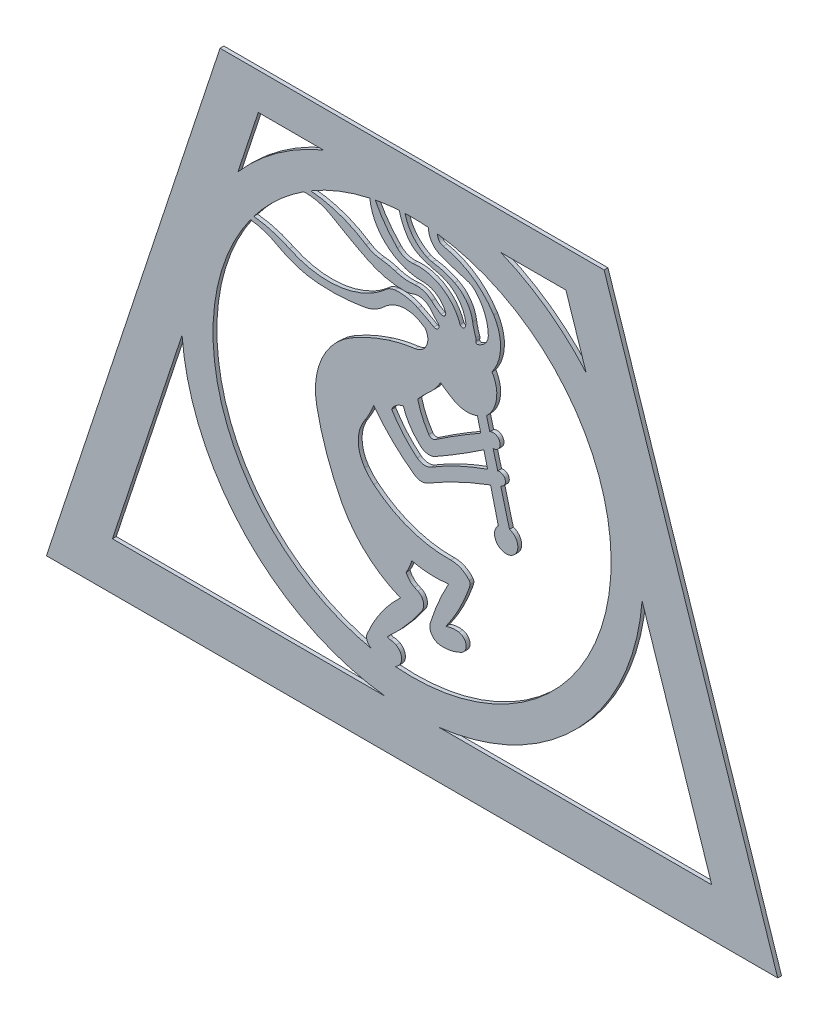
from build123d import *

# Parameters (mm, degrees)
BOSS_EXTRUDE1_DEPTH = 6.35


with BuildPart() as part:
    # Model → Boss-Extrude1 (new body)
    with BuildSketch(Plane.XY):
        Polygon((-355.683969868, 310.919702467), (-642.116316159, -557.460324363), (564.383683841, -557.460324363), (277.95133755, 310.919702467), align=None)
        with BuildLine():
            Line((-82.977968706, -478.720324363), (-533.231339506, -478.720324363))
            Line((-533.231339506, -478.720324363), (-418.350189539, -130.433905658))
            ThreePointArc((-418.350189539, -130.433905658), (-313.063598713, -364.66290745), (-82.977968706, -478.720324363))
        make_face(mode=Mode.SUBTRACT)
        with BuildLine():
            ThreePointArc((-113.19013671, -404.849817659), (-112.400886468, -415.691031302), (-103.949326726, -422.526670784))
            ThreePointArc((-103.949326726, -422.526670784), (-344.586283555, -220.577883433), (-305.474493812, 91.126665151))
            ThreePointArc((-305.474493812, 91.126665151), (-282.394363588, 86.159913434), (-260.831638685, 76.546905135))
            ThreePointArc((-260.831638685, 76.546905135), (-228.528995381, 62.512276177), (-193.900261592, 56.087140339))
            ThreePointArc((-193.900261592, 56.087140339), (-155.687471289, 55.731105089), (-117.714824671, 60.023215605))
            ThreePointArc((-117.714824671, 60.023215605), (-100.26348824, 65.852929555), (-85.291060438, 76.546905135))
            ThreePointArc((-85.291060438, 76.546905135), (-75.955065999, 83.805188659), (-65.27740604, 88.887614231))
            ThreePointArc((-65.27740604, 88.887614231), (-42.904202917, 91.123987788), (-21.965915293, 82.929495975))
            ThreePointArc((-21.965915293, 82.929495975), (-20.268598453, 81.850539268), (-18.484641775, 80.921814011))
            ThreePointArc((-18.484641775, 80.921814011), (-17.313302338, 80.14995648), (-16.413266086, 79.073975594))
            ThreePointArc((-16.413266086, 79.073975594), (-15.207691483, 56.087140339), (-33.856354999, 42.593610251))
            ThreePointArc((-33.856354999, 42.593610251), (-55.885482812, 38.747961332), (-77.481253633, 32.943293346))
            ThreePointArc((-77.481253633, 32.943293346), (-109.431154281, 20.770376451), (-139.802673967, 5.068566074))
            ThreePointArc((-139.802673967, 5.068566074), (-187.921004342, -48.811676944), (-196.047600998, -120.591985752))
            ThreePointArc((-196.047600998, -120.591985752), (-179.590921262, -180.773932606), (-154.720726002, -237.994229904))
            ThreePointArc((-154.720726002, -237.994229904), (-114.179016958, -290.43293551), (-58.002011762, -325.61236281))
            ThreePointArc((-58.002011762, -325.61236281), (-89.82843825, -362.283289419), (-113.19013671, -404.849817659))
        make_face(mode=Mode.SUBTRACT)
        with BuildLine():
            Line((340.617557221, -130.433905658), (455.498707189, -478.720324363))
            Line((455.498707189, -478.720324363), (5.245336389, -478.720324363))
            ThreePointArc((5.245336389, -478.720324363), (235.330966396, -364.66290745), (340.617557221, -130.433905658))
        make_face(mode=Mode.SUBTRACT)
        with BuildLine():
            Line((-326.147226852, 149.098808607), (-292.632403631, 250.706058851))
            Line((-292.632403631, 250.706058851), (-185.349195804, 250.706058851))
            ThreePointArc((-185.349195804, 250.706058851), (-261.619014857, 208.037656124), (-326.147226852, 149.098808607))
        make_face(mode=Mode.SUBTRACT)
        with BuildLine():
            ThreePointArc((-82.228886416, 102.978990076), (-93.975797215, 93.535803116), (-106.726278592, 85.499080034))
            ThreePointArc((-106.726278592, 85.499080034), (-173.491689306, 67.301481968), (-241.14593954, 81.85053927))
            ThreePointArc((-241.14593954, 81.85053927), (-269.827249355, 92.770969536), (-299.965843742, 98.56220933))
            ThreePointArc((-299.965843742, 98.56220933), (-262.040850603, 140.291990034), (-217.536225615, 174.918830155))
            ThreePointArc((-217.536225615, 174.918830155), (-193.04261506, 172.244649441), (-170.341728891, 162.665611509))
            ThreePointArc((-170.341728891, 162.665611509), (-141.704772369, 146.078511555), (-112.440538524, 130.624975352))
            ThreePointArc((-112.440538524, 130.624975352), (-82.792599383, 119.847214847), (-51.449295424, 116.275420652))
            ThreePointArc((-51.449295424, 116.275420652), (-44.056739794, 117.000722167), (-36.928593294, 119.090092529))
            ThreePointArc((-36.928593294, 119.090092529), (-21.266411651, 120.014438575), (-8.149144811, 111.406554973))
            ThreePointArc((-8.149144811, 111.406554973), (-2.309804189, 104.464922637), (3.924128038, 97.875366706))
            ThreePointArc((3.924128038, 97.875366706), (4.433592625, 90.385615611), (-2.922487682, 88.887614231))
            ThreePointArc((-2.922487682, 88.887614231), (-16.005398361, 96.111442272), (-29.278793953, 102.978990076))
            ThreePointArc((-29.278793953, 102.978990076), (-47.727090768, 109.101732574), (-67.154006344, 109.751795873))
            ThreePointArc((-67.154006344, 109.751795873), (-75.224405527, 107.551650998), (-82.228886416, 102.978990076))
        make_face(mode=Mode.SUBTRACT)
        with BuildLine():
            ThreePointArc((-90.290443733, 141.958938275), (-103.053420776, 144.713569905), (-114.751190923, 150.513893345))
            ThreePointArc((-114.751190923, 150.513893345), (-158.424024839, 172.050610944), (-206.088555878, 182.012493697))
            ThreePointArc((-206.088555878, 182.012493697), (-158.868773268, 205.064855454), (-108.576794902, 220.291022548))
            ThreePointArc((-108.576794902, 220.291022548), (-102.583430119, 197.164363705), (-90.168395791, 176.752854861))
            ThreePointArc((-90.168395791, 176.752854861), (-59.321974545, 152.981413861), (-21.266411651, 144.713569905))
            ThreePointArc((-21.266411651, 144.713569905), (1.272640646, 138.049911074), (16.299222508, 119.977416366))
            ThreePointArc((16.299222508, 119.977416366), (14.97267176, 113.943834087), (8.842400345, 113.179880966))
            ThreePointArc((8.842400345, 113.179880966), (0.664579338, 118.279660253), (-6.76620035, 124.417087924))
            ThreePointArc((-6.76620035, 124.417087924), (-19.411326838, 132.006675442), (-34.072987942, 133.599395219))
            ThreePointArc((-34.072987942, 133.599395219), (-50.804621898, 133.589482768), (-67.154006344, 137.145506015))
            ThreePointArc((-67.154006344, 137.145506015), (-78.581964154, 140.226405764), (-90.290443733, 141.958938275))
        make_face(mode=Mode.SUBTRACT)
        with BuildLine():
            Line((85.715554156, -69.987132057), (85.710410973, -69.989006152))
            ThreePointArc((85.710410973, -69.989006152), (38.106369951, -89.240462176), (-7.227212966, -113.357459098))
            ThreePointArc((-7.227212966, -113.357459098), (-19.17915239, -116.207351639), (-30.588730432, -111.647497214))
            ThreePointArc((-30.588730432, -111.647497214), (-53.61814559, -89.275287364), (-72.604345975, -63.383320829))
            ThreePointArc((-72.604345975, -63.383320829), (-64.668004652, -53.878526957), (-53.218975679, -49.1619227))
            ThreePointArc((-53.218975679, -49.1619227), (-41.59859394, -73.035723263), (-23.898401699, -92.827004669))
            ThreePointArc((-23.898401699, -92.827004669), (-12.661855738, -97.553011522), (-0.742605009, -94.998296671))
            ThreePointArc((-0.742605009, -94.998296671), (39.918665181, -70.87297718), (79.597073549, -45.163176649))
            Line((79.597073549, -45.163176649), (85.715554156, -69.987132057))
        make_face(mode=Mode.SUBTRACT)
        with BuildLine():
            ThreePointArc((103.434089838, -141.874936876), (120.716798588, -174.886235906), (121.809660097, -137.640517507))
            Line((121.809660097, -137.640517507), (107.341819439, -82.735476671))
            Line((107.341819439, -82.735476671), (107.588580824, -82.628494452))
            ThreePointArc((107.588580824, -82.628494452), (114.809086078, -70.536342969), (102.381253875, -63.910272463))
            Line((102.381253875, -63.910272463), (94.994111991, -35.876280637))
            ThreePointArc((94.994111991, -35.876280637), (95.2215504, -35.754945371), (95.449169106, -35.633948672))
            ThreePointArc((95.449169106, -35.633948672), (105.948694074, -21.136240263), (89.346483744, -14.443693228))
            Line((89.346483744, -14.443693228), (84.00883033, 5.812548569))
            ThreePointArc((84.00883033, 5.812548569), (100.452490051, 37.790603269), (93.013357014, 72.970842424))
            ThreePointArc((93.013357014, 72.970842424), (107.087762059, 113.857194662), (95.733162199, 155.580758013))
            ThreePointArc((95.733162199, 155.580758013), (60.042720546, 192.524508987), (12.63048004, 212.291345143))
            ThreePointArc((12.63048004, 212.291345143), (5.469188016, 216.842082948), (3.329845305, 225.052839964))
            ThreePointArc((3.329845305, 225.052839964), (287.644020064, -135.882575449), (-67.154006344, -427.819699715))
            ThreePointArc((-67.154006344, -427.819699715), (-56.197810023, -412.84128312), (-65.157325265, -396.589566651))
            ThreePointArc((-65.157325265, -396.589566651), (-69.973189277, -394.648067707), (-75.106515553, -393.86645036))
            ThreePointArc((-75.106515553, -393.86645036), (-77.520180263, -393.14198019), (-79.267396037, -391.325975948))
            ThreePointArc((-79.267396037, -391.325975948), (-49.016941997, -360.712060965), (-22.785731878, -326.591313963))
            ThreePointArc((-22.785731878, -326.591313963), (-20.354122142, -312.530826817), (-29.249351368, -301.373545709))
            ThreePointArc((-29.249351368, -301.373545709), (-32.247950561, -300.206106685), (-35.158192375, -298.83315236))
            ThreePointArc((-35.158192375, -298.83315236), (-43.19100603, -292.708827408), (-48.622753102, -284.192397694))
            ThreePointArc((-48.622753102, -284.192397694), (-43.284424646, -274.019161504), (-39.316975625, -263.237147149))
            ThreePointArc((-39.316975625, -263.237147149), (-9.116063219, -267.414880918), (21.340909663, -266.028745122))
            ThreePointArc((21.340909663, -266.028745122), (4.573942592, -300.449451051), (-8.681930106, -336.36877761))
            ThreePointArc((-8.681930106, -336.36877761), (-6.217481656, -352.54193554), (8.061937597, -360.525839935))
            ThreePointArc((8.061937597, -360.525839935), (25.968437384, -359.098217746), (42.851616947, -352.963147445))
            ThreePointArc((42.851616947, -352.963147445), (50.262615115, -338.1287647), (38.534984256, -326.405092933))
            ThreePointArc((38.534984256, -326.405092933), (27.473736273, -326.17401138), (16.77884206, -329.006650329))
            ThreePointArc((16.77884206, -329.006650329), (38.649923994, -293.402228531), (55.305632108, -255.079826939))
            ThreePointArc((55.305632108, -255.079826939), (56.154021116, -252.277858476), (56.743975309, -249.410325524))
            ThreePointArc((56.743975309, -249.410325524), (56.595474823, -246.575850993), (55.305632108, -244.047491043))
            ThreePointArc((55.305632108, -244.047491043), (41.766778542, -233.517662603), (24.972014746, -230.03718104))
            ThreePointArc((24.972014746, -230.03718104), (-42.601054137, -219.378978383), (-102.058321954, -185.547776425))
            ThreePointArc((-102.058321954, -185.547776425), (-110.154747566, -177.787652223), (-117.151634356, -169.023223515))
            ThreePointArc((-117.151634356, -169.023223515), (-127.666759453, -135.990255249), (-117.753326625, -102.771755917))
            ThreePointArc((-117.753326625, -102.771755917), (-109.113154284, -88.107326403), (-102.187250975, -72.559659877))
            ThreePointArc((-102.187250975, -72.559659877), (-71.182309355, -107.963885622), (-35.049314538, -138.116369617))
            ThreePointArc((-35.049314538, -138.116369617), (-24.142086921, -141.849197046), (-12.959423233, -139.047474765))
            ThreePointArc((-12.959423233, -139.047474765), (37.727296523, -112.159280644), (90.642007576, -89.974783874))
            Line((90.642007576, -89.974783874), (103.434089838, -141.874936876))
        make_face(mode=Mode.SUBTRACT)
        with BuildLine():
            ThreePointArc((29.229864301, 1.083696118), (48.742015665, -4.854616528), (68.905522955, -1.785319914))
            Line((68.905522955, -1.785319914), (74.389880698, -24.036506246))
            ThreePointArc((74.389880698, -24.036506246), (74.387364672, -24.037936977), (74.384848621, -24.039367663))
            ThreePointArc((74.384848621, -24.039367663), (36.390754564, -46.63963106), (-0.688719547, -70.711101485))
            ThreePointArc((-0.688719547, -70.711101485), (-6.404198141, -71.884716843), (-11.274409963, -68.671446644))
            ThreePointArc((-11.274409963, -68.671446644), (-22.281800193, -48.764779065), (-29.564764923, -27.214918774))
            ThreePointArc((-29.564764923, -27.214918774), (-17.997233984, -14.968476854), (-5.84670301, -3.30024182))
            ThreePointArc((-5.84670301, -3.30024182), (1.94994827, 5.296769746), (8.014329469, 15.192206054))
            ThreePointArc((8.014329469, 15.192206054), (18.381545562, 7.77622437), (29.229864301, 1.083696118))
        make_face(mode=Mode.SUBTRACT)
        with BuildLine():
            ThreePointArc((-99.749732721, 222.082028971), (-79.986331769, 225.190459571), (-60.07032787, 227.089708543))
            ThreePointArc((-60.07032787, 227.089708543), (-54.641576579, 211.169011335), (-46.589338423, 196.400754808))
            ThreePointArc((-46.589338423, 196.400754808), (-36.743702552, 185.548080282), (-24.096103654, 178.148395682))
            ThreePointArc((-24.096103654, 178.148395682), (-10.264984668, 173.339932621), (3.924128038, 169.721887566))
            ThreePointArc((3.924128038, 169.721887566), (33.835507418, 153.295039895), (49.550349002, 123.003527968))
            ThreePointArc((49.550349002, 123.003527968), (49.674420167, 118.40798254), (48.376860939, 113.997679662))
            ThreePointArc((48.376860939, 113.997679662), (44.169928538, 111.488213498), (40.248586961, 114.423989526))
            ThreePointArc((40.248586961, 114.423989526), (10.090111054, 152.087432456), (-36.986111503, 162.665611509))
            ThreePointArc((-36.986111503, 162.665611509), (-51.333391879, 164.263959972), (-63.523188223, 171.997525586))
            ThreePointArc((-63.523188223, 171.997525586), (-83.54390124, 195.660109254), (-99.749732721, 222.082028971))
        make_face(mode=Mode.SUBTRACT)
        with BuildLine():
            ThreePointArc((-11.791081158, 226.656955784), (-6.449875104, 208.655393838), (8.255800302, 196.979443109))
            ThreePointArc((8.255800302, 196.979443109), (29.986001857, 189.263330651), (52.064130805, 182.607786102))
            ThreePointArc((52.064130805, 182.607786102), (59.222486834, 179.545273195), (65.29807644, 174.676160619))
            ThreePointArc((65.29807644, 174.676160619), (81.048046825, 150.305572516), (86.875822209, 121.879806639))
            ThreePointArc((86.875822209, 121.879806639), (85.437898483, 114.030652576), (81.088482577, 107.340404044))
            ThreePointArc((81.088482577, 107.340404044), (75.811902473, 103.061719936), (69.696661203, 100.103129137))
            ThreePointArc((69.696661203, 100.103129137), (67.012397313, 100.708464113), (66.371944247, 103.384566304))
            ThreePointArc((66.371944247, 103.384566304), (66.721917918, 105.620037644), (66.32039672, 107.846827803))
            ThreePointArc((66.32039672, 107.846827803), (63.222606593, 117.95938655), (61.108139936, 128.322261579))
            ThreePointArc((61.108139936, 128.322261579), (51.183996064, 152.418335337), (31.342034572, 169.312297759))
            ThreePointArc((31.342034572, 169.312297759), (13.377405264, 176.522503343), (-5.558227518, 180.542053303))
            ThreePointArc((-5.558227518, 180.542053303), (-9.933633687, 181.436520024), (-14.114633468, 183.006071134))
            ThreePointArc((-14.114633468, 183.006071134), (-37.377394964, 201.140611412), (-50.473882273, 227.569755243))
            ThreePointArc((-50.473882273, 227.569755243), (-31.119026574, 227.683560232), (-11.791081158, 226.656955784))
        make_face(mode=Mode.SUBTRACT)
        with BuildLine():
            ThreePointArc((248.414594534, 149.098808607), (183.88638254, 208.037656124), (107.616563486, 250.706058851))
            Line((107.616563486, 250.706058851), (214.899771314, 250.706058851))
            Line((214.899771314, 250.706058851), (248.414594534, 149.098808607))
        make_face(mode=Mode.SUBTRACT)
    extrude(amount=BOSS_EXTRUDE1_DEPTH)


solid = part.part
